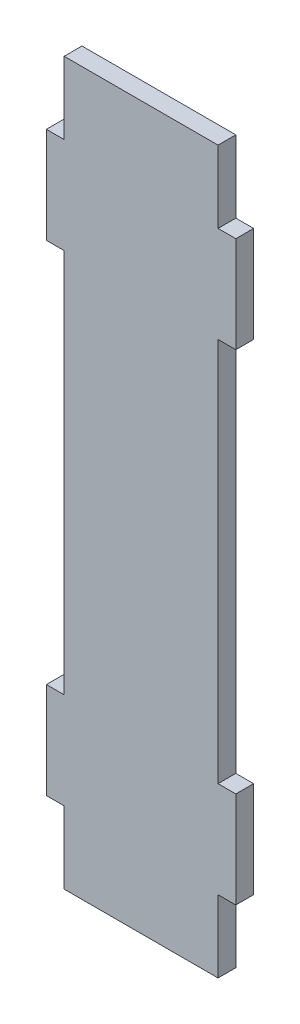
ISO-10303-21;
HEADER;
FILE_DESCRIPTION(('STEP AP214'),'2;1');
FILE_NAME('part.step','',(''),(''),'','','');
FILE_SCHEMA(('AUTOMOTIVE_DESIGN { 1 0 10303 214 1 1 1 1 }'));
ENDSEC;
DATA;
#1=APPLICATION_CONTEXT('core data for automotive mechanical design processes');
#2=APPLICATION_PROTOCOL_DEFINITION('international standard','automotive_design',2000,#1);
#3=PRODUCT_CONTEXT('',#1,'mechanical');
#4=PRODUCT('Part','Part','',(#3));
#5=PRODUCT_RELATED_PRODUCT_CATEGORY('part','',(#4));
#6=PRODUCT_DEFINITION_FORMATION('','',#4);
#7=PRODUCT_DEFINITION_CONTEXT('part definition',#1,'design');
#8=PRODUCT_DEFINITION('design','',#6,#7);
#9=PRODUCT_DEFINITION_SHAPE('','',#8);
#10=(LENGTH_UNIT() NAMED_UNIT(*) SI_UNIT(.MILLI.,.METRE.));
#11=(NAMED_UNIT(*) PLANE_ANGLE_UNIT() SI_UNIT($,.RADIAN.));
#12=(NAMED_UNIT(*) SI_UNIT($,.STERADIAN.) SOLID_ANGLE_UNIT());
#13=UNCERTAINTY_MEASURE_WITH_UNIT(LENGTH_MEASURE(1.E-05),#10,'distance_accuracy_value','');
#14=(GEOMETRIC_REPRESENTATION_CONTEXT(3) GLOBAL_UNCERTAINTY_ASSIGNED_CONTEXT((#13)) GLOBAL_UNIT_ASSIGNED_CONTEXT((#10,
#11,#12)) REPRESENTATION_CONTEXT('',''));
#15=CARTESIAN_POINT('',(0.,0.,0.));
#16=DIRECTION('',(0.,0.,1.));
#17=DIRECTION('',(1.,0.,0.));
#18=AXIS2_PLACEMENT_3D('',#15,#16,#17);
#19=CARTESIAN_POINT('',(-16.,150.,3.7));
#20=DIRECTION('',(1.,0.,0.));
#21=DIRECTION('',(0.,1.,0.));
#22=AXIS2_PLACEMENT_3D('',#19,#20,#21);
#23=PLANE('',#22);
#24=DIRECTION('',(0.,-1.,0.));
#25=VECTOR('',#24,1.);
#26=CARTESIAN_POINT('',(-16.,150.,0.));
#27=LINE('',#26,#25);
#28=CARTESIAN_POINT('',(-16.,150.,0.));
#29=VERTEX_POINT('',#28);
#30=CARTESIAN_POINT('',(-16.,135.,0.));
#31=VERTEX_POINT('',#30);
#32=EDGE_CURVE('E201',#29,#31,#27,.T.);
#33=ORIENTED_EDGE('',*,*,#32,.T.);
#34=DIRECTION('',(0.,0.,-1.));
#35=VECTOR('',#34,1.);
#36=CARTESIAN_POINT('',(-16.,135.,3.7));
#37=LINE('',#36,#35);
#38=CARTESIAN_POINT('',(-16.,135.,3.7));
#39=VERTEX_POINT('',#38);
#40=EDGE_CURVE('E11',#39,#31,#37,.T.);
#41=ORIENTED_EDGE('',*,*,#40,.F.);
#42=DIRECTION('',(0.,-1.,0.));
#43=VECTOR('',#42,1.);
#44=CARTESIAN_POINT('',(-16.,150.,3.7));
#45=LINE('',#44,#43);
#46=CARTESIAN_POINT('',(-16.,150.,3.7));
#47=VERTEX_POINT('',#46);
#48=EDGE_CURVE('E239',#47,#39,#45,.T.);
#49=ORIENTED_EDGE('',*,*,#48,.F.);
#50=DIRECTION('',(0.,0.,-1.));
#51=VECTOR('',#50,1.);
#52=CARTESIAN_POINT('',(-16.,150.,3.7));
#53=LINE('',#52,#51);
#54=EDGE_CURVE('E197',#47,#29,#53,.T.);
#55=ORIENTED_EDGE('',*,*,#54,.T.);
#56=EDGE_LOOP('',(#33,#41,#49,#55));
#57=FACE_BOUND('',#56,.T.);
#58=ADVANCED_FACE('F33',(#57),#23,.F.);
#59=CARTESIAN_POINT('',(-19.7,135.,3.7));
#60=DIRECTION('',(0.,-1.,0.));
#61=DIRECTION('',(0.,0.,-1.));
#62=AXIS2_PLACEMENT_3D('',#59,#60,#61);
#63=PLANE('',#62);
#64=DIRECTION('',(-1.,0.,0.));
#65=VECTOR('',#64,1.);
#66=CARTESIAN_POINT('',(-19.7,135.,0.));
#67=LINE('',#66,#65);
#68=CARTESIAN_POINT('',(-19.7,135.,0.));
#69=VERTEX_POINT('',#68);
#70=EDGE_CURVE('E204',#31,#69,#67,.T.);
#71=ORIENTED_EDGE('',*,*,#70,.T.);
#72=DIRECTION('',(0.,0.,-1.));
#73=VECTOR('',#72,1.);
#74=CARTESIAN_POINT('',(-19.7,135.,3.7));
#75=LINE('',#74,#73);
#76=CARTESIAN_POINT('',(-19.7,135.,3.7));
#77=VERTEX_POINT('',#76);
#78=EDGE_CURVE('E41',#77,#69,#75,.T.);
#79=ORIENTED_EDGE('',*,*,#78,.F.);
#80=DIRECTION('',(-1.,0.,0.));
#81=VECTOR('',#80,1.);
#82=CARTESIAN_POINT('',(-19.7,135.,3.7));
#83=LINE('',#82,#81);
#84=EDGE_CURVE('E128',#39,#77,#83,.T.);
#85=ORIENTED_EDGE('',*,*,#84,.F.);
#86=ORIENTED_EDGE('',*,*,#40,.T.);
#87=EDGE_LOOP('',(#71,#79,#85,#86));
#88=FACE_BOUND('',#87,.T.);
#89=ADVANCED_FACE('F357',(#88),#63,.F.);
#90=CARTESIAN_POINT('',(-19.7,135.,3.7));
#91=DIRECTION('',(1.,0.,0.));
#92=DIRECTION('',(0.,1.,0.));
#93=AXIS2_PLACEMENT_3D('',#90,#91,#92);
#94=PLANE('',#93);
#95=DIRECTION('',(0.,-1.,0.));
#96=VECTOR('',#95,1.);
#97=CARTESIAN_POINT('',(-19.7,135.,0.));
#98=LINE('',#97,#96);
#99=CARTESIAN_POINT('',(-19.7,115.,0.));
#100=VERTEX_POINT('',#99);
#101=EDGE_CURVE('E206',#69,#100,#98,.T.);
#102=ORIENTED_EDGE('',*,*,#101,.T.);
#103=DIRECTION('',(0.,0.,-1.));
#104=VECTOR('',#103,1.);
#105=CARTESIAN_POINT('',(-19.7,115.,3.7));
#106=LINE('',#105,#104);
#107=CARTESIAN_POINT('',(-19.7,115.,3.7));
#108=VERTEX_POINT('',#107);
#109=EDGE_CURVE('E282',#108,#100,#106,.T.);
#110=ORIENTED_EDGE('',*,*,#109,.F.);
#111=DIRECTION('',(0.,-1.,0.));
#112=VECTOR('',#111,1.);
#113=CARTESIAN_POINT('',(-19.7,135.,3.7));
#114=LINE('',#113,#112);
#115=EDGE_CURVE('E290',#77,#108,#114,.T.);
#116=ORIENTED_EDGE('',*,*,#115,.F.);
#117=ORIENTED_EDGE('',*,*,#78,.T.);
#118=EDGE_LOOP('',(#102,#110,#116,#117));
#119=FACE_BOUND('',#118,.T.);
#120=ADVANCED_FACE('F288',(#119),#94,.F.);
#121=CARTESIAN_POINT('',(-19.7,115.,3.7));
#122=DIRECTION('',(0.,1.,0.));
#123=DIRECTION('',(0.,0.,1.));
#124=AXIS2_PLACEMENT_3D('',#121,#122,#123);
#125=PLANE('',#124);
#126=DIRECTION('',(1.,0.,0.));
#127=VECTOR('',#126,1.);
#128=CARTESIAN_POINT('',(-19.7,115.,0.));
#129=LINE('',#128,#127);
#130=CARTESIAN_POINT('',(-16.,115.,0.));
#131=VERTEX_POINT('',#130);
#132=EDGE_CURVE('E208',#100,#131,#129,.T.);
#133=ORIENTED_EDGE('',*,*,#132,.T.);
#134=DIRECTION('',(0.,0.,-1.));
#135=VECTOR('',#134,1.);
#136=CARTESIAN_POINT('',(-16.,115.,3.7));
#137=LINE('',#136,#135);
#138=CARTESIAN_POINT('',(-16.,115.,3.7));
#139=VERTEX_POINT('',#138);
#140=EDGE_CURVE('E279',#139,#131,#137,.T.);
#141=ORIENTED_EDGE('',*,*,#140,.F.);
#142=DIRECTION('',(1.,0.,0.));
#143=VECTOR('',#142,1.);
#144=CARTESIAN_POINT('',(-19.7,115.,3.7));
#145=LINE('',#144,#143);
#146=EDGE_CURVE('E308',#108,#139,#145,.T.);
#147=ORIENTED_EDGE('',*,*,#146,.F.);
#148=ORIENTED_EDGE('',*,*,#109,.T.);
#149=EDGE_LOOP('',(#133,#141,#147,#148));
#150=FACE_BOUND('',#149,.T.);
#151=ADVANCED_FACE('F299',(#150),#125,.F.);
#152=CARTESIAN_POINT('',(-16.,115.,3.7));
#153=DIRECTION('',(1.,0.,0.));
#154=DIRECTION('',(0.,1.,0.));
#155=AXIS2_PLACEMENT_3D('',#152,#153,#154);
#156=PLANE('',#155);
#157=DIRECTION('',(0.,-1.,0.));
#158=VECTOR('',#157,1.);
#159=CARTESIAN_POINT('',(-16.,115.,0.));
#160=LINE('',#159,#158);
#161=CARTESIAN_POINT('',(-16.,35.,0.));
#162=VERTEX_POINT('',#161);
#163=EDGE_CURVE('E210',#131,#162,#160,.T.);
#164=ORIENTED_EDGE('',*,*,#163,.T.);
#165=DIRECTION('',(0.,0.,-1.));
#166=VECTOR('',#165,1.);
#167=CARTESIAN_POINT('',(-16.,35.,3.7));
#168=LINE('',#167,#166);
#169=CARTESIAN_POINT('',(-16.,35.,3.7));
#170=VERTEX_POINT('',#169);
#171=EDGE_CURVE('E276',#170,#162,#168,.T.);
#172=ORIENTED_EDGE('',*,*,#171,.F.);
#173=DIRECTION('',(0.,-1.,0.));
#174=VECTOR('',#173,1.);
#175=CARTESIAN_POINT('',(-16.,115.,3.7));
#176=LINE('',#175,#174);
#177=EDGE_CURVE('E305',#139,#170,#176,.T.);
#178=ORIENTED_EDGE('',*,*,#177,.F.);
#179=ORIENTED_EDGE('',*,*,#140,.T.);
#180=EDGE_LOOP('',(#164,#172,#178,#179));
#181=FACE_BOUND('',#180,.T.);
#182=ADVANCED_FACE('F303',(#181),#156,.F.);
#183=CARTESIAN_POINT('',(-19.7,35.,3.7));
#184=DIRECTION('',(0.,-1.,0.));
#185=DIRECTION('',(1.,0.,0.));
#186=AXIS2_PLACEMENT_3D('',#183,#184,#185);
#187=PLANE('',#186);
#188=DIRECTION('',(-1.,0.,0.));
#189=VECTOR('',#188,1.);
#190=CARTESIAN_POINT('',(-19.7,35.,0.));
#191=LINE('',#190,#189);
#192=CARTESIAN_POINT('',(-19.7,35.,0.));
#193=VERTEX_POINT('',#192);
#194=EDGE_CURVE('E212',#162,#193,#191,.T.);
#195=ORIENTED_EDGE('',*,*,#194,.T.);
#196=DIRECTION('',(0.,0.,-1.));
#197=VECTOR('',#196,1.);
#198=CARTESIAN_POINT('',(-19.7,35.,3.7));
#199=LINE('',#198,#197);
#200=CARTESIAN_POINT('',(-19.7,35.,3.7));
#201=VERTEX_POINT('',#200);
#202=EDGE_CURVE('E273',#201,#193,#199,.T.);
#203=ORIENTED_EDGE('',*,*,#202,.F.);
#204=DIRECTION('',(-1.,0.,0.));
#205=VECTOR('',#204,1.);
#206=CARTESIAN_POINT('',(-19.7,35.,3.7));
#207=LINE('',#206,#205);
#208=EDGE_CURVE('E307',#170,#201,#207,.T.);
#209=ORIENTED_EDGE('',*,*,#208,.F.);
#210=ORIENTED_EDGE('',*,*,#171,.T.);
#211=EDGE_LOOP('',(#195,#203,#209,#210));
#212=FACE_BOUND('',#211,.T.);
#213=ADVANCED_FACE('F370',(#212),#187,.F.);
#214=CARTESIAN_POINT('',(-19.7,35.,3.7));
#215=DIRECTION('',(1.,0.,0.));
#216=DIRECTION('',(0.,1.,0.));
#217=AXIS2_PLACEMENT_3D('',#214,#215,#216);
#218=PLANE('',#217);
#219=DIRECTION('',(0.,-1.,0.));
#220=VECTOR('',#219,1.);
#221=CARTESIAN_POINT('',(-19.7,35.,0.));
#222=LINE('',#221,#220);
#223=CARTESIAN_POINT('',(-19.7,15.,0.));
#224=VERTEX_POINT('',#223);
#225=EDGE_CURVE('E214',#193,#224,#222,.T.);
#226=ORIENTED_EDGE('',*,*,#225,.T.);
#227=DIRECTION('',(0.,0.,-1.));
#228=VECTOR('',#227,1.);
#229=CARTESIAN_POINT('',(-19.7,15.,3.7));
#230=LINE('',#229,#228);
#231=CARTESIAN_POINT('',(-19.7,15.,3.7));
#232=VERTEX_POINT('',#231);
#233=EDGE_CURVE('E270',#232,#224,#230,.T.);
#234=ORIENTED_EDGE('',*,*,#233,.F.);
#235=DIRECTION('',(0.,-1.,0.));
#236=VECTOR('',#235,1.);
#237=CARTESIAN_POINT('',(-19.7,35.,3.7));
#238=LINE('',#237,#236);
#239=EDGE_CURVE('E310',#201,#232,#238,.T.);
#240=ORIENTED_EDGE('',*,*,#239,.F.);
#241=ORIENTED_EDGE('',*,*,#202,.T.);
#242=EDGE_LOOP('',(#226,#234,#240,#241));
#243=FACE_BOUND('',#242,.T.);
#244=ADVANCED_FACE('F373',(#243),#218,.F.);
#245=CARTESIAN_POINT('',(-19.7,15.,3.7));
#246=DIRECTION('',(0.,1.,0.));
#247=DIRECTION('',(-1.,0.,0.));
#248=AXIS2_PLACEMENT_3D('',#245,#246,#247);
#249=PLANE('',#248);
#250=DIRECTION('',(1.,0.,0.));
#251=VECTOR('',#250,1.);
#252=CARTESIAN_POINT('',(-19.7,15.,0.));
#253=LINE('',#252,#251);
#254=CARTESIAN_POINT('',(-16.,15.,0.));
#255=VERTEX_POINT('',#254);
#256=EDGE_CURVE('E216',#224,#255,#253,.T.);
#257=ORIENTED_EDGE('',*,*,#256,.T.);
#258=DIRECTION('',(0.,0.,-1.));
#259=VECTOR('',#258,1.);
#260=CARTESIAN_POINT('',(-16.,15.,3.7));
#261=LINE('',#260,#259);
#262=CARTESIAN_POINT('',(-16.,15.,3.7));
#263=VERTEX_POINT('',#262);
#264=EDGE_CURVE('E267',#263,#255,#261,.T.);
#265=ORIENTED_EDGE('',*,*,#264,.F.);
#266=DIRECTION('',(1.,0.,0.));
#267=VECTOR('',#266,1.);
#268=CARTESIAN_POINT('',(-19.7,15.,3.7));
#269=LINE('',#268,#267);
#270=EDGE_CURVE('E316',#232,#263,#269,.T.);
#271=ORIENTED_EDGE('',*,*,#270,.F.);
#272=ORIENTED_EDGE('',*,*,#233,.T.);
#273=EDGE_LOOP('',(#257,#265,#271,#272));
#274=FACE_BOUND('',#273,.T.);
#275=ADVANCED_FACE('F377',(#274),#249,.F.);
#276=CARTESIAN_POINT('',(-16.,15.,3.7));
#277=DIRECTION('',(1.,0.,0.));
#278=DIRECTION('',(0.,1.,0.));
#279=AXIS2_PLACEMENT_3D('',#276,#277,#278);
#280=PLANE('',#279);
#281=DIRECTION('',(0.,-1.,0.));
#282=VECTOR('',#281,1.);
#283=CARTESIAN_POINT('',(-16.,15.,0.));
#284=LINE('',#283,#282);
#285=CARTESIAN_POINT('',(-16.,0.,0.));
#286=VERTEX_POINT('',#285);
#287=EDGE_CURVE('E218',#255,#286,#284,.T.);
#288=ORIENTED_EDGE('',*,*,#287,.T.);
#289=DIRECTION('',(0.,0.,-1.));
#290=VECTOR('',#289,1.);
#291=CARTESIAN_POINT('',(-16.,0.,3.7));
#292=LINE('',#291,#290);
#293=CARTESIAN_POINT('',(-16.,0.,3.7));
#294=VERTEX_POINT('',#293);
#295=EDGE_CURVE('E264',#294,#286,#292,.T.);
#296=ORIENTED_EDGE('',*,*,#295,.F.);
#297=DIRECTION('',(0.,-1.,0.));
#298=VECTOR('',#297,1.);
#299=CARTESIAN_POINT('',(-16.,15.,3.7));
#300=LINE('',#299,#298);
#301=EDGE_CURVE('E318',#263,#294,#300,.T.);
#302=ORIENTED_EDGE('',*,*,#301,.F.);
#303=ORIENTED_EDGE('',*,*,#264,.T.);
#304=EDGE_LOOP('',(#288,#296,#302,#303));
#305=FACE_BOUND('',#304,.T.);
#306=ADVANCED_FACE('F381',(#305),#280,.F.);
#307=CARTESIAN_POINT('',(-16.,0.,3.7));
#308=DIRECTION('',(0.,1.,0.));
#309=DIRECTION('',(0.,0.,1.));
#310=AXIS2_PLACEMENT_3D('',#307,#308,#309);
#311=PLANE('',#310);
#312=DIRECTION('',(1.,0.,0.));
#313=VECTOR('',#312,1.);
#314=CARTESIAN_POINT('',(-16.,0.,0.));
#315=LINE('',#314,#313);
#316=CARTESIAN_POINT('',(16.,0.,0.));
#317=VERTEX_POINT('',#316);
#318=EDGE_CURVE('E220',#286,#317,#315,.T.);
#319=ORIENTED_EDGE('',*,*,#318,.T.);
#320=DIRECTION('',(0.,0.,-1.));
#321=VECTOR('',#320,1.);
#322=CARTESIAN_POINT('',(16.,0.,3.7));
#323=LINE('',#322,#321);
#324=CARTESIAN_POINT('',(16.,0.,3.7));
#325=VERTEX_POINT('',#324);
#326=EDGE_CURVE('E261',#325,#317,#323,.T.);
#327=ORIENTED_EDGE('',*,*,#326,.F.);
#328=DIRECTION('',(1.,0.,0.));
#329=VECTOR('',#328,1.);
#330=CARTESIAN_POINT('',(-16.,0.,3.7));
#331=LINE('',#330,#329);
#332=EDGE_CURVE('E320',#294,#325,#331,.T.);
#333=ORIENTED_EDGE('',*,*,#332,.F.);
#334=ORIENTED_EDGE('',*,*,#295,.T.);
#335=EDGE_LOOP('',(#319,#327,#333,#334));
#336=FACE_BOUND('',#335,.T.);
#337=ADVANCED_FACE('F385',(#336),#311,.F.);
#338=CARTESIAN_POINT('',(16.,15.,3.7));
#339=DIRECTION('',(-1.,0.,0.));
#340=DIRECTION('',(0.,-1.,0.));
#341=AXIS2_PLACEMENT_3D('',#338,#339,#340);
#342=PLANE('',#341);
#343=DIRECTION('',(0.,1.,0.));
#344=VECTOR('',#343,1.);
#345=CARTESIAN_POINT('',(16.,15.,0.));
#346=LINE('',#345,#344);
#347=CARTESIAN_POINT('',(16.,15.,0.));
#348=VERTEX_POINT('',#347);
#349=EDGE_CURVE('E222',#317,#348,#346,.T.);
#350=ORIENTED_EDGE('',*,*,#349,.T.);
#351=DIRECTION('',(0.,0.,-1.));
#352=VECTOR('',#351,1.);
#353=CARTESIAN_POINT('',(16.,15.,3.7));
#354=LINE('',#353,#352);
#355=CARTESIAN_POINT('',(16.,15.,3.7));
#356=VERTEX_POINT('',#355);
#357=EDGE_CURVE('E258',#356,#348,#354,.T.);
#358=ORIENTED_EDGE('',*,*,#357,.F.);
#359=DIRECTION('',(0.,1.,0.));
#360=VECTOR('',#359,1.);
#361=CARTESIAN_POINT('',(16.,15.,3.7));
#362=LINE('',#361,#360);
#363=EDGE_CURVE('E322',#325,#356,#362,.T.);
#364=ORIENTED_EDGE('',*,*,#363,.F.);
#365=ORIENTED_EDGE('',*,*,#326,.T.);
#366=EDGE_LOOP('',(#350,#358,#364,#365));
#367=FACE_BOUND('',#366,.T.);
#368=ADVANCED_FACE('F389',(#367),#342,.F.);
#369=CARTESIAN_POINT('',(16.,15.,3.7));
#370=DIRECTION('',(0.,1.,0.));
#371=DIRECTION('',(-1.,0.,0.));
#372=AXIS2_PLACEMENT_3D('',#369,#370,#371);
#373=PLANE('',#372);
#374=DIRECTION('',(1.,0.,0.));
#375=VECTOR('',#374,1.);
#376=CARTESIAN_POINT('',(16.,15.,0.));
#377=LINE('',#376,#375);
#378=CARTESIAN_POINT('',(19.7,15.,0.));
#379=VERTEX_POINT('',#378);
#380=EDGE_CURVE('E224',#348,#379,#377,.T.);
#381=ORIENTED_EDGE('',*,*,#380,.T.);
#382=DIRECTION('',(0.,0.,-1.));
#383=VECTOR('',#382,1.);
#384=CARTESIAN_POINT('',(19.7,15.,3.7));
#385=LINE('',#384,#383);
#386=CARTESIAN_POINT('',(19.7,15.,3.7));
#387=VERTEX_POINT('',#386);
#388=EDGE_CURVE('E255',#387,#379,#385,.T.);
#389=ORIENTED_EDGE('',*,*,#388,.F.);
#390=DIRECTION('',(1.,0.,0.));
#391=VECTOR('',#390,1.);
#392=CARTESIAN_POINT('',(16.,15.,3.7));
#393=LINE('',#392,#391);
#394=EDGE_CURVE('E324',#356,#387,#393,.T.);
#395=ORIENTED_EDGE('',*,*,#394,.F.);
#396=ORIENTED_EDGE('',*,*,#357,.T.);
#397=EDGE_LOOP('',(#381,#389,#395,#396));
#398=FACE_BOUND('',#397,.T.);
#399=ADVANCED_FACE('F393',(#398),#373,.F.);
#400=CARTESIAN_POINT('',(19.7,35.,3.7));
#401=DIRECTION('',(-1.,0.,0.));
#402=DIRECTION('',(0.,-1.,0.));
#403=AXIS2_PLACEMENT_3D('',#400,#401,#402);
#404=PLANE('',#403);
#405=DIRECTION('',(0.,1.,0.));
#406=VECTOR('',#405,1.);
#407=CARTESIAN_POINT('',(19.7,35.,0.));
#408=LINE('',#407,#406);
#409=CARTESIAN_POINT('',(19.7,35.,0.));
#410=VERTEX_POINT('',#409);
#411=EDGE_CURVE('E226',#379,#410,#408,.T.);
#412=ORIENTED_EDGE('',*,*,#411,.T.);
#413=DIRECTION('',(0.,0.,-1.));
#414=VECTOR('',#413,1.);
#415=CARTESIAN_POINT('',(19.7,35.,3.7));
#416=LINE('',#415,#414);
#417=CARTESIAN_POINT('',(19.7,35.,3.7));
#418=VERTEX_POINT('',#417);
#419=EDGE_CURVE('E252',#418,#410,#416,.T.);
#420=ORIENTED_EDGE('',*,*,#419,.F.);
#421=DIRECTION('',(0.,1.,0.));
#422=VECTOR('',#421,1.);
#423=CARTESIAN_POINT('',(19.7,35.,3.7));
#424=LINE('',#423,#422);
#425=EDGE_CURVE('E326',#387,#418,#424,.T.);
#426=ORIENTED_EDGE('',*,*,#425,.F.);
#427=ORIENTED_EDGE('',*,*,#388,.T.);
#428=EDGE_LOOP('',(#412,#420,#426,#427));
#429=FACE_BOUND('',#428,.T.);
#430=ADVANCED_FACE('F397',(#429),#404,.F.);
#431=CARTESIAN_POINT('',(16.,35.,3.7));
#432=DIRECTION('',(0.,-1.,0.));
#433=DIRECTION('',(1.,0.,0.));
#434=AXIS2_PLACEMENT_3D('',#431,#432,#433);
#435=PLANE('',#434);
#436=DIRECTION('',(-1.,0.,0.));
#437=VECTOR('',#436,1.);
#438=CARTESIAN_POINT('',(16.,35.,0.));
#439=LINE('',#438,#437);
#440=CARTESIAN_POINT('',(16.,35.,0.));
#441=VERTEX_POINT('',#440);
#442=EDGE_CURVE('E228',#410,#441,#439,.T.);
#443=ORIENTED_EDGE('',*,*,#442,.T.);
#444=DIRECTION('',(0.,0.,-1.));
#445=VECTOR('',#444,1.);
#446=CARTESIAN_POINT('',(16.,35.,3.7));
#447=LINE('',#446,#445);
#448=CARTESIAN_POINT('',(16.,35.,3.7));
#449=VERTEX_POINT('',#448);
#450=EDGE_CURVE('E249',#449,#441,#447,.T.);
#451=ORIENTED_EDGE('',*,*,#450,.F.);
#452=DIRECTION('',(-1.,0.,0.));
#453=VECTOR('',#452,1.);
#454=CARTESIAN_POINT('',(16.,35.,3.7));
#455=LINE('',#454,#453);
#456=EDGE_CURVE('E328',#418,#449,#455,.T.);
#457=ORIENTED_EDGE('',*,*,#456,.F.);
#458=ORIENTED_EDGE('',*,*,#419,.T.);
#459=EDGE_LOOP('',(#443,#451,#457,#458));
#460=FACE_BOUND('',#459,.T.);
#461=ADVANCED_FACE('F401',(#460),#435,.F.);
#462=CARTESIAN_POINT('',(16.,115.,3.7));
#463=DIRECTION('',(-1.,0.,0.));
#464=DIRECTION('',(0.,-1.,0.));
#465=AXIS2_PLACEMENT_3D('',#462,#463,#464);
#466=PLANE('',#465);
#467=DIRECTION('',(0.,1.,0.));
#468=VECTOR('',#467,1.);
#469=CARTESIAN_POINT('',(16.,115.,0.));
#470=LINE('',#469,#468);
#471=CARTESIAN_POINT('',(16.,115.,0.));
#472=VERTEX_POINT('',#471);
#473=EDGE_CURVE('E230',#441,#472,#470,.T.);
#474=ORIENTED_EDGE('',*,*,#473,.T.);
#475=DIRECTION('',(0.,0.,-1.));
#476=VECTOR('',#475,1.);
#477=CARTESIAN_POINT('',(16.,115.,3.7));
#478=LINE('',#477,#476);
#479=CARTESIAN_POINT('',(16.,115.,3.7));
#480=VERTEX_POINT('',#479);
#481=EDGE_CURVE('E246',#480,#472,#478,.T.);
#482=ORIENTED_EDGE('',*,*,#481,.F.);
#483=DIRECTION('',(0.,1.,0.));
#484=VECTOR('',#483,1.);
#485=CARTESIAN_POINT('',(16.,115.,3.7));
#486=LINE('',#485,#484);
#487=EDGE_CURVE('E330',#449,#480,#486,.T.);
#488=ORIENTED_EDGE('',*,*,#487,.F.);
#489=ORIENTED_EDGE('',*,*,#450,.T.);
#490=EDGE_LOOP('',(#474,#482,#488,#489));
#491=FACE_BOUND('',#490,.T.);
#492=ADVANCED_FACE('F405',(#491),#466,.F.);
#493=CARTESIAN_POINT('',(16.,115.,3.7));
#494=DIRECTION('',(0.,1.,0.));
#495=DIRECTION('',(0.,0.,1.));
#496=AXIS2_PLACEMENT_3D('',#493,#494,#495);
#497=PLANE('',#496);
#498=DIRECTION('',(1.,0.,0.));
#499=VECTOR('',#498,1.);
#500=CARTESIAN_POINT('',(16.,115.,0.));
#501=LINE('',#500,#499);
#502=CARTESIAN_POINT('',(19.7,115.,0.));
#503=VERTEX_POINT('',#502);
#504=EDGE_CURVE('E232',#472,#503,#501,.T.);
#505=ORIENTED_EDGE('',*,*,#504,.T.);
#506=DIRECTION('',(0.,0.,-1.));
#507=VECTOR('',#506,1.);
#508=CARTESIAN_POINT('',(19.7,115.,3.7));
#509=LINE('',#508,#507);
#510=CARTESIAN_POINT('',(19.7,115.,3.7));
#511=VERTEX_POINT('',#510);
#512=EDGE_CURVE('E243',#511,#503,#509,.T.);
#513=ORIENTED_EDGE('',*,*,#512,.F.);
#514=DIRECTION('',(1.,0.,0.));
#515=VECTOR('',#514,1.);
#516=CARTESIAN_POINT('',(16.,115.,3.7));
#517=LINE('',#516,#515);
#518=EDGE_CURVE('E332',#480,#511,#517,.T.);
#519=ORIENTED_EDGE('',*,*,#518,.F.);
#520=ORIENTED_EDGE('',*,*,#481,.T.);
#521=EDGE_LOOP('',(#505,#513,#519,#520));
#522=FACE_BOUND('',#521,.T.);
#523=ADVANCED_FACE('F338',(#522),#497,.F.);
#524=CARTESIAN_POINT('',(19.7,135.,3.7));
#525=DIRECTION('',(-1.,0.,0.));
#526=DIRECTION('',(0.,-1.,0.));
#527=AXIS2_PLACEMENT_3D('',#524,#525,#526);
#528=PLANE('',#527);
#529=DIRECTION('',(0.,1.,0.));
#530=VECTOR('',#529,1.);
#531=CARTESIAN_POINT('',(19.7,135.,0.));
#532=LINE('',#531,#530);
#533=CARTESIAN_POINT('',(19.7,135.,0.));
#534=VERTEX_POINT('',#533);
#535=EDGE_CURVE('E234',#503,#534,#532,.T.);
#536=ORIENTED_EDGE('',*,*,#535,.T.);
#537=DIRECTION('',(0.,0.,-1.));
#538=VECTOR('',#537,1.);
#539=CARTESIAN_POINT('',(19.7,135.,3.7));
#540=LINE('',#539,#538);
#541=CARTESIAN_POINT('',(19.7,135.,3.7));
#542=VERTEX_POINT('',#541);
#543=EDGE_CURVE('E192',#542,#534,#540,.T.);
#544=ORIENTED_EDGE('',*,*,#543,.F.);
#545=DIRECTION('',(0.,1.,0.));
#546=VECTOR('',#545,1.);
#547=CARTESIAN_POINT('',(19.7,135.,3.7));
#548=LINE('',#547,#546);
#549=EDGE_CURVE('E183',#511,#542,#548,.T.);
#550=ORIENTED_EDGE('',*,*,#549,.F.);
#551=ORIENTED_EDGE('',*,*,#512,.T.);
#552=EDGE_LOOP('',(#536,#544,#550,#551));
#553=FACE_BOUND('',#552,.T.);
#554=ADVANCED_FACE('F342',(#553),#528,.F.);
#555=CARTESIAN_POINT('',(16.,135.,3.7));
#556=DIRECTION('',(0.,-1.,0.));
#557=DIRECTION('',(0.,0.,-1.));
#558=AXIS2_PLACEMENT_3D('',#555,#556,#557);
#559=PLANE('',#558);
#560=DIRECTION('',(-1.,0.,0.));
#561=VECTOR('',#560,1.);
#562=CARTESIAN_POINT('',(16.,135.,0.));
#563=LINE('',#562,#561);
#564=CARTESIAN_POINT('',(16.,135.,0.));
#565=VERTEX_POINT('',#564);
#566=EDGE_CURVE('E191',#534,#565,#563,.T.);
#567=ORIENTED_EDGE('',*,*,#566,.T.);
#568=DIRECTION('',(0.,0.,-1.));
#569=VECTOR('',#568,1.);
#570=CARTESIAN_POINT('',(16.,135.,3.7));
#571=LINE('',#570,#569);
#572=CARTESIAN_POINT('',(16.,135.,3.7));
#573=VERTEX_POINT('',#572);
#574=EDGE_CURVE('E188',#573,#565,#571,.T.);
#575=ORIENTED_EDGE('',*,*,#574,.F.);
#576=DIRECTION('',(-1.,0.,0.));
#577=VECTOR('',#576,1.);
#578=CARTESIAN_POINT('',(16.,135.,3.7));
#579=LINE('',#578,#577);
#580=EDGE_CURVE('E177',#542,#573,#579,.T.);
#581=ORIENTED_EDGE('',*,*,#580,.F.);
#582=ORIENTED_EDGE('',*,*,#543,.T.);
#583=EDGE_LOOP('',(#567,#575,#581,#582));
#584=FACE_BOUND('',#583,.T.);
#585=ADVANCED_FACE('F189',(#584),#559,.F.);
#586=CARTESIAN_POINT('',(16.,150.,3.7));
#587=DIRECTION('',(-1.,0.,0.));
#588=DIRECTION('',(0.,-1.,0.));
#589=AXIS2_PLACEMENT_3D('',#586,#587,#588);
#590=PLANE('',#589);
#591=DIRECTION('',(0.,1.,0.));
#592=VECTOR('',#591,1.);
#593=CARTESIAN_POINT('',(16.,150.,0.));
#594=LINE('',#593,#592);
#595=CARTESIAN_POINT('',(16.,150.,0.));
#596=VERTEX_POINT('',#595);
#597=EDGE_CURVE('E114',#565,#596,#594,.T.);
#598=ORIENTED_EDGE('',*,*,#597,.T.);
#599=DIRECTION('',(0.,0.,-1.));
#600=VECTOR('',#599,1.);
#601=CARTESIAN_POINT('',(16.,150.,3.7));
#602=LINE('',#601,#600);
#603=CARTESIAN_POINT('',(16.,150.,3.7));
#604=VERTEX_POINT('',#603);
#605=EDGE_CURVE('E193',#604,#596,#602,.T.);
#606=ORIENTED_EDGE('',*,*,#605,.F.);
#607=DIRECTION('',(0.,1.,0.));
#608=VECTOR('',#607,1.);
#609=CARTESIAN_POINT('',(16.,150.,3.7));
#610=LINE('',#609,#608);
#611=EDGE_CURVE('E181',#573,#604,#610,.T.);
#612=ORIENTED_EDGE('',*,*,#611,.F.);
#613=ORIENTED_EDGE('',*,*,#574,.T.);
#614=EDGE_LOOP('',(#598,#606,#612,#613));
#615=FACE_BOUND('',#614,.T.);
#616=ADVANCED_FACE('F195',(#615),#590,.F.);
#617=CARTESIAN_POINT('',(-16.,150.,3.7));
#618=DIRECTION('',(0.,-1.,0.));
#619=DIRECTION('',(0.,0.,-1.));
#620=AXIS2_PLACEMENT_3D('',#617,#618,#619);
#621=PLANE('',#620);
#622=DIRECTION('',(-1.,0.,0.));
#623=VECTOR('',#622,1.);
#624=CARTESIAN_POINT('',(-16.,150.,0.));
#625=LINE('',#624,#623);
#626=EDGE_CURVE('E120',#596,#29,#625,.T.);
#627=ORIENTED_EDGE('',*,*,#626,.T.);
#628=ORIENTED_EDGE('',*,*,#54,.F.);
#629=DIRECTION('',(-1.,0.,0.));
#630=VECTOR('',#629,1.);
#631=CARTESIAN_POINT('',(-16.,150.,3.7));
#632=LINE('',#631,#630);
#633=EDGE_CURVE('E49',#604,#47,#632,.T.);
#634=ORIENTED_EDGE('',*,*,#633,.F.);
#635=ORIENTED_EDGE('',*,*,#605,.T.);
#636=EDGE_LOOP('',(#627,#628,#634,#635));
#637=FACE_BOUND('',#636,.T.);
#638=ADVANCED_FACE('F346',(#637),#621,.F.);
#639=CARTESIAN_POINT('',(-16.,135.,3.7));
#640=DIRECTION('',(0.,0.,1.));
#641=DIRECTION('',(1.,0.,0.));
#642=AXIS2_PLACEMENT_3D('',#639,#640,#641);
#643=PLANE('',#642);
#644=ORIENTED_EDGE('',*,*,#48,.T.);
#645=ORIENTED_EDGE('',*,*,#84,.T.);
#646=ORIENTED_EDGE('',*,*,#115,.T.);
#647=ORIENTED_EDGE('',*,*,#146,.T.);
#648=ORIENTED_EDGE('',*,*,#177,.T.);
#649=ORIENTED_EDGE('',*,*,#208,.T.);
#650=ORIENTED_EDGE('',*,*,#239,.T.);
#651=ORIENTED_EDGE('',*,*,#270,.T.);
#652=ORIENTED_EDGE('',*,*,#301,.T.);
#653=ORIENTED_EDGE('',*,*,#332,.T.);
#654=ORIENTED_EDGE('',*,*,#363,.T.);
#655=ORIENTED_EDGE('',*,*,#394,.T.);
#656=ORIENTED_EDGE('',*,*,#425,.T.);
#657=ORIENTED_EDGE('',*,*,#456,.T.);
#658=ORIENTED_EDGE('',*,*,#487,.T.);
#659=ORIENTED_EDGE('',*,*,#518,.T.);
#660=ORIENTED_EDGE('',*,*,#549,.T.);
#661=ORIENTED_EDGE('',*,*,#580,.T.);
#662=ORIENTED_EDGE('',*,*,#611,.T.);
#663=ORIENTED_EDGE('',*,*,#633,.T.);
#664=EDGE_LOOP('',(#644,#645,#646,#647,#648,#649,#650,#651,#652,#653,#654,#655,#656,#657,#658,
#659,#660,#661,#662,#663));
#665=FACE_BOUND('',#664,.T.);
#666=ADVANCED_FACE('F179',(#665),#643,.T.);
#667=CARTESIAN_POINT('',(-16.,135.,0.));
#668=DIRECTION('',(0.,0.,1.));
#669=DIRECTION('',(1.,0.,0.));
#670=AXIS2_PLACEMENT_3D('',#667,#668,#669);
#671=PLANE('',#670);
#672=ORIENTED_EDGE('',*,*,#32,.F.);
#673=ORIENTED_EDGE('',*,*,#626,.F.);
#674=ORIENTED_EDGE('',*,*,#597,.F.);
#675=ORIENTED_EDGE('',*,*,#566,.F.);
#676=ORIENTED_EDGE('',*,*,#535,.F.);
#677=ORIENTED_EDGE('',*,*,#504,.F.);
#678=ORIENTED_EDGE('',*,*,#473,.F.);
#679=ORIENTED_EDGE('',*,*,#442,.F.);
#680=ORIENTED_EDGE('',*,*,#411,.F.);
#681=ORIENTED_EDGE('',*,*,#380,.F.);
#682=ORIENTED_EDGE('',*,*,#349,.F.);
#683=ORIENTED_EDGE('',*,*,#318,.F.);
#684=ORIENTED_EDGE('',*,*,#287,.F.);
#685=ORIENTED_EDGE('',*,*,#256,.F.);
#686=ORIENTED_EDGE('',*,*,#225,.F.);
#687=ORIENTED_EDGE('',*,*,#194,.F.);
#688=ORIENTED_EDGE('',*,*,#163,.F.);
#689=ORIENTED_EDGE('',*,*,#132,.F.);
#690=ORIENTED_EDGE('',*,*,#101,.F.);
#691=ORIENTED_EDGE('',*,*,#70,.F.);
#692=EDGE_LOOP('',(#672,#673,#674,#675,#676,#677,#678,#679,#680,#681,#682,#683,#684,#685,#686,
#687,#688,#689,#690,#691));
#693=FACE_BOUND('',#692,.T.);
#694=ADVANCED_FACE('F294',(#693),#671,.F.);
#695=CLOSED_SHELL('',(#58,#89,#120,#151,#182,#213,#244,#275,#306,#337,#368,#399,#430,#461,#492,
#523,#554,#585,#616,#638,#666,#694));
#696=MANIFOLD_SOLID_BREP('B2',#695);
#697=ADVANCED_BREP_SHAPE_REPRESENTATION('',(#18,#696),#14);
#698=SHAPE_DEFINITION_REPRESENTATION(#9,#697);
ENDSEC;
END-ISO-10303-21;
